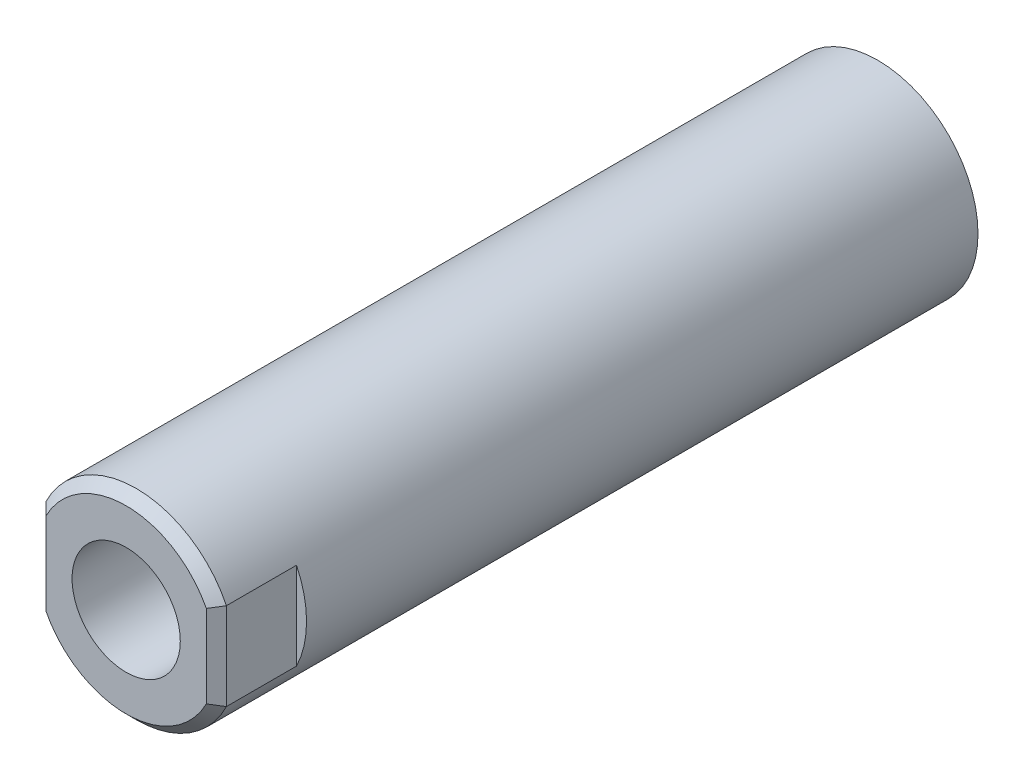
ISO-10303-21;
HEADER;
FILE_DESCRIPTION(('STEP AP214'),'2;1');
FILE_NAME('part.step','',(''),(''),'','','');
FILE_SCHEMA(('AUTOMOTIVE_DESIGN { 1 0 10303 214 1 1 1 1 }'));
ENDSEC;
DATA;
#1=APPLICATION_CONTEXT('core data for automotive mechanical design processes');
#2=APPLICATION_PROTOCOL_DEFINITION('international standard','automotive_design',2000,#1);
#3=PRODUCT_CONTEXT('',#1,'mechanical');
#4=PRODUCT('Part','Part','',(#3));
#5=PRODUCT_RELATED_PRODUCT_CATEGORY('part','',(#4));
#6=PRODUCT_DEFINITION_FORMATION('','',#4);
#7=PRODUCT_DEFINITION_CONTEXT('part definition',#1,'design');
#8=PRODUCT_DEFINITION('design','',#6,#7);
#9=PRODUCT_DEFINITION_SHAPE('','',#8);
#10=(LENGTH_UNIT() NAMED_UNIT(*) SI_UNIT(.MILLI.,.METRE.));
#11=(NAMED_UNIT(*) PLANE_ANGLE_UNIT() SI_UNIT($,.RADIAN.));
#12=(NAMED_UNIT(*) SI_UNIT($,.STERADIAN.) SOLID_ANGLE_UNIT());
#13=UNCERTAINTY_MEASURE_WITH_UNIT(LENGTH_MEASURE(1.E-05),#10,'distance_accuracy_value','');
#14=(GEOMETRIC_REPRESENTATION_CONTEXT(3) GLOBAL_UNCERTAINTY_ASSIGNED_CONTEXT((#13)) GLOBAL_UNIT_ASSIGNED_CONTEXT((#10,
#11,#12)) REPRESENTATION_CONTEXT('',''));
#15=CARTESIAN_POINT('',(0.,0.,0.));
#16=DIRECTION('',(0.,0.,1.));
#17=DIRECTION('',(1.,0.,0.));
#18=AXIS2_PLACEMENT_3D('',#15,#16,#17);
#19=CARTESIAN_POINT('',(0.,0.,-75.));
#20=DIRECTION('',(0.,0.,1.));
#21=DIRECTION('',(1.,0.,0.));
#22=AXIS2_PLACEMENT_3D('',#19,#20,#21);
#23=CYLINDRICAL_SURFACE('',#22,10.);
#24=DIRECTION('',(0.,0.,1.));
#25=VECTOR('',#24,1.);
#26=CARTESIAN_POINT('',(9.,-4.35889894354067,-75.));
#27=LINE('',#26,#25);
#28=CARTESIAN_POINT('',(9.,-4.35889894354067,-0.999999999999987));
#29=VERTEX_POINT('',#28);
#30=CARTESIAN_POINT('',(9.,-4.35889894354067,-7.99999999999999));
#31=VERTEX_POINT('',#30);
#32=EDGE_CURVE('E120',#29,#31,#27,.F.);
#33=ORIENTED_EDGE('',*,*,#32,.F.);
#34=CARTESIAN_POINT('',(0.,0.,-1.));
#35=DIRECTION('',(0.,0.,1.));
#36=DIRECTION('',(1.,0.,0.));
#37=AXIS2_PLACEMENT_3D('',#34,#35,#36);
#38=CIRCLE('',#37,10.);
#39=CARTESIAN_POINT('',(-9.,-4.35889894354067,-0.999999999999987));
#40=VERTEX_POINT('',#39);
#41=EDGE_CURVE('E46',#29,#40,#38,.F.);
#42=ORIENTED_EDGE('',*,*,#41,.T.);
#43=DIRECTION('',(0.,0.,1.));
#44=VECTOR('',#43,1.);
#45=CARTESIAN_POINT('',(-9.,-4.35889894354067,-75.));
#46=LINE('',#45,#44);
#47=CARTESIAN_POINT('',(-9.,-4.35889894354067,-8.));
#48=VERTEX_POINT('',#47);
#49=EDGE_CURVE('E106',#48,#40,#46,.T.);
#50=ORIENTED_EDGE('',*,*,#49,.F.);
#51=CARTESIAN_POINT('',(0.,0.,-7.99999999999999));
#52=DIRECTION('',(0.,0.,-1.));
#53=DIRECTION('',(-1.,0.,0.));
#54=AXIS2_PLACEMENT_3D('',#51,#52,#53);
#55=CIRCLE('',#54,10.);
#56=CARTESIAN_POINT('',(-9.,4.35889894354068,-8.));
#57=VERTEX_POINT('',#56);
#58=EDGE_CURVE('E127',#57,#48,#55,.F.);
#59=ORIENTED_EDGE('',*,*,#58,.F.);
#60=DIRECTION('',(0.,0.,1.));
#61=VECTOR('',#60,1.);
#62=CARTESIAN_POINT('',(-9.,4.35889894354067,-75.));
#63=LINE('',#62,#61);
#64=CARTESIAN_POINT('',(-9.,4.35889894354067,-0.999999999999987));
#65=VERTEX_POINT('',#64);
#66=EDGE_CURVE('E112',#65,#57,#63,.F.);
#67=ORIENTED_EDGE('',*,*,#66,.F.);
#68=CARTESIAN_POINT('',(0.,0.,-1.));
#69=DIRECTION('',(0.,0.,1.));
#70=DIRECTION('',(1.,0.,0.));
#71=AXIS2_PLACEMENT_3D('',#68,#69,#70);
#72=CIRCLE('',#71,10.);
#73=CARTESIAN_POINT('',(9.,4.35889894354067,-0.999999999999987));
#74=VERTEX_POINT('',#73);
#75=EDGE_CURVE('E141',#65,#74,#72,.F.);
#76=ORIENTED_EDGE('',*,*,#75,.T.);
#77=DIRECTION('',(0.,0.,1.));
#78=VECTOR('',#77,1.);
#79=CARTESIAN_POINT('',(9.,4.35889894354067,-75.));
#80=LINE('',#79,#78);
#81=CARTESIAN_POINT('',(9.,4.35889894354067,-7.99999999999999));
#82=VERTEX_POINT('',#81);
#83=EDGE_CURVE('E117',#82,#74,#80,.T.);
#84=ORIENTED_EDGE('',*,*,#83,.F.);
#85=CARTESIAN_POINT('',(0.,0.,-7.99999999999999));
#86=DIRECTION('',(0.,0.,-1.));
#87=DIRECTION('',(-1.,0.,0.));
#88=AXIS2_PLACEMENT_3D('',#85,#86,#87);
#89=CIRCLE('',#88,10.);
#90=EDGE_CURVE('E125',#31,#82,#89,.F.);
#91=ORIENTED_EDGE('',*,*,#90,.F.);
#92=EDGE_LOOP('',(#33,#42,#50,#59,#67,#76,#84,#91));
#93=FACE_BOUND('',#92,.T.);
#94=CARTESIAN_POINT('',(0.,0.,-75.));
#95=DIRECTION('',(0.,0.,1.));
#96=DIRECTION('',(1.,0.,0.));
#97=AXIS2_PLACEMENT_3D('',#94,#95,#96);
#98=CIRCLE('',#97,10.);
#99=CARTESIAN_POINT('',(10.,0.,-75.));
#100=VERTEX_POINT('',#99);
#101=EDGE_CURVE('E122',#100,#100,#98,.T.);
#102=ORIENTED_EDGE('',*,*,#101,.T.);
#103=EDGE_LOOP('',(#102));
#104=FACE_BOUND('',#103,.T.);
#105=ADVANCED_FACE('F33',(#93,#104),#23,.T.);
#106=CARTESIAN_POINT('',(0.,0.,-75.));
#107=DIRECTION('',(0.,0.,1.));
#108=DIRECTION('',(1.,0.,0.));
#109=AXIS2_PLACEMENT_3D('',#106,#107,#108);
#110=PLANE('',#109);
#111=ORIENTED_EDGE('',*,*,#101,.F.);
#112=EDGE_LOOP('',(#111));
#113=FACE_BOUND('',#112,.T.);
#114=ADVANCED_FACE('F176',(#113),#110,.F.);
#115=CARTESIAN_POINT('',(0.,0.,0.));
#116=DIRECTION('',(0.,0.,1.));
#117=DIRECTION('',(1.,0.,0.));
#118=AXIS2_PLACEMENT_3D('',#115,#116,#117);
#119=PLANE('',#118);
#120=CARTESIAN_POINT('',(0.,0.,0.));
#121=DIRECTION('',(0.,0.,1.));
#122=DIRECTION('',(1.,0.,0.));
#123=AXIS2_PLACEMENT_3D('',#120,#121,#122);
#124=CIRCLE('',#123,9.00000000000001);
#125=CARTESIAN_POINT('',(-8.00000000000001,-4.12310562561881,0.));
#126=VERTEX_POINT('',#125);
#127=CARTESIAN_POINT('',(7.99999999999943,-4.12310562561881,0.));
#128=VERTEX_POINT('',#127);
#129=EDGE_CURVE('E136',#126,#128,#124,.T.);
#130=ORIENTED_EDGE('',*,*,#129,.T.);
#131=DIRECTION('',(0.,1.,0.));
#132=VECTOR('',#131,1.);
#133=CARTESIAN_POINT('',(8.00000000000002,4.35889894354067,0.));
#134=LINE('',#133,#132);
#135=CARTESIAN_POINT('',(7.99999999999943,4.12310562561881,0.));
#136=VERTEX_POINT('',#135);
#137=EDGE_CURVE('E138',#128,#136,#134,.T.);
#138=ORIENTED_EDGE('',*,*,#137,.T.);
#139=CARTESIAN_POINT('',(0.,0.,0.));
#140=DIRECTION('',(0.,0.,1.));
#141=DIRECTION('',(1.,0.,0.));
#142=AXIS2_PLACEMENT_3D('',#139,#140,#141);
#143=CIRCLE('',#142,9.00000000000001);
#144=CARTESIAN_POINT('',(-7.99999999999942,4.12310562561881,0.));
#145=VERTEX_POINT('',#144);
#146=EDGE_CURVE('E132',#136,#145,#143,.T.);
#147=ORIENTED_EDGE('',*,*,#146,.T.);
#148=DIRECTION('',(0.,-1.,0.));
#149=VECTOR('',#148,1.);
#150=CARTESIAN_POINT('',(-8.00000000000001,-4.35889894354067,0.));
#151=LINE('',#150,#149);
#152=EDGE_CURVE('E134',#145,#126,#151,.T.);
#153=ORIENTED_EDGE('',*,*,#152,.T.);
#154=EDGE_LOOP('',(#130,#138,#147,#153));
#155=FACE_BOUND('',#154,.T.);
#156=CARTESIAN_POINT('',(0.,0.,0.));
#157=DIRECTION('',(0.,0.,1.));
#158=DIRECTION('',(1.,0.,0.));
#159=AXIS2_PLACEMENT_3D('',#156,#157,#158);
#160=CIRCLE('',#159,5.39999999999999);
#161=CARTESIAN_POINT('',(5.39999999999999,0.,0.));
#162=VERTEX_POINT('',#161);
#163=EDGE_CURVE('E103',#162,#162,#160,.T.);
#164=ORIENTED_EDGE('',*,*,#163,.F.);
#165=EDGE_LOOP('',(#164));
#166=FACE_BOUND('',#165,.T.);
#167=ADVANCED_FACE('F180',(#155,#166),#119,.T.);
#168=CARTESIAN_POINT('',(9.,-10.5,0.));
#169=DIRECTION('',(-1.,0.,0.));
#170=DIRECTION('',(0.,0.,1.));
#171=AXIS2_PLACEMENT_3D('',#168,#169,#170);
#172=PLANE('',#171);
#173=ORIENTED_EDGE('',*,*,#83,.T.);
#174=DIRECTION('',(0.,-1.,0.));
#175=VECTOR('',#174,1.);
#176=CARTESIAN_POINT('',(9.,-4.35889894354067,-0.999999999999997));
#177=LINE('',#176,#175);
#178=EDGE_CURVE('E129',#74,#29,#177,.T.);
#179=ORIENTED_EDGE('',*,*,#178,.T.);
#180=ORIENTED_EDGE('',*,*,#32,.T.);
#181=DIRECTION('',(0.,1.,0.));
#182=VECTOR('',#181,1.);
#183=CARTESIAN_POINT('',(9.,-10.5,-8.));
#184=LINE('',#183,#182);
#185=EDGE_CURVE('E114',#31,#82,#184,.T.);
#186=ORIENTED_EDGE('',*,*,#185,.T.);
#187=EDGE_LOOP('',(#173,#179,#180,#186));
#188=FACE_BOUND('',#187,.T.);
#189=ADVANCED_FACE('F186',(#188),#172,.F.);
#190=CARTESIAN_POINT('',(9.,-10.5,-8.));
#191=DIRECTION('',(0.,0.,-1.));
#192=DIRECTION('',(-1.,0.,0.));
#193=AXIS2_PLACEMENT_3D('',#190,#191,#192);
#194=PLANE('',#193);
#195=ORIENTED_EDGE('',*,*,#90,.T.);
#196=ORIENTED_EDGE('',*,*,#185,.F.);
#197=EDGE_LOOP('',(#195,#196));
#198=FACE_BOUND('',#197,.T.);
#199=ADVANCED_FACE('F191',(#198),#194,.F.);
#200=CARTESIAN_POINT('',(-11.5,-10.5,-8.));
#201=DIRECTION('',(0.,0.,-1.));
#202=DIRECTION('',(-1.,0.,0.));
#203=AXIS2_PLACEMENT_3D('',#200,#201,#202);
#204=PLANE('',#203);
#205=ORIENTED_EDGE('',*,*,#58,.T.);
#206=DIRECTION('',(0.,1.,0.));
#207=VECTOR('',#206,1.);
#208=CARTESIAN_POINT('',(-9.,-10.5,-8.));
#209=LINE('',#208,#207);
#210=EDGE_CURVE('E102',#48,#57,#209,.T.);
#211=ORIENTED_EDGE('',*,*,#210,.T.);
#212=EDGE_LOOP('',(#205,#211));
#213=FACE_BOUND('',#212,.T.);
#214=ADVANCED_FACE('F195',(#213),#204,.F.);
#215=CARTESIAN_POINT('',(-9.,-10.5,0.));
#216=DIRECTION('',(1.,0.,0.));
#217=DIRECTION('',(0.,0.,-1.));
#218=AXIS2_PLACEMENT_3D('',#215,#216,#217);
#219=PLANE('',#218);
#220=ORIENTED_EDGE('',*,*,#49,.T.);
#221=DIRECTION('',(0.,1.,0.));
#222=VECTOR('',#221,1.);
#223=CARTESIAN_POINT('',(-9.,4.35889894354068,-0.999999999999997));
#224=LINE('',#223,#222);
#225=EDGE_CURVE('E11',#40,#65,#224,.T.);
#226=ORIENTED_EDGE('',*,*,#225,.T.);
#227=ORIENTED_EDGE('',*,*,#66,.T.);
#228=ORIENTED_EDGE('',*,*,#210,.F.);
#229=EDGE_LOOP('',(#220,#226,#227,#228));
#230=FACE_BOUND('',#229,.T.);
#231=ADVANCED_FACE('F96',(#230),#219,.F.);
#232=CARTESIAN_POINT('',(0.,0.,-24.75));
#233=DIRECTION('',(0.,0.,1.));
#234=DIRECTION('',(1.,0.,0.));
#235=AXIS2_PLACEMENT_3D('',#232,#233,#234);
#236=CONICAL_SURFACE('',#235,5.39999999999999,1.02974425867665);
#237=CARTESIAN_POINT('',(0.,0.,-27.9946473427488));
#238=VERTEX_POINT('',#237);
#239=VERTEX_LOOP('',#238);
#240=FACE_BOUND('',#239,.T.);
#241=CARTESIAN_POINT('',(0.,0.,-24.75));
#242=DIRECTION('',(0.,0.,1.));
#243=DIRECTION('',(1.,0.,0.));
#244=AXIS2_PLACEMENT_3D('',#241,#242,#243);
#245=CIRCLE('',#244,5.39999999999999);
#246=CARTESIAN_POINT('',(5.39999999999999,0.,-24.75));
#247=VERTEX_POINT('',#246);
#248=EDGE_CURVE('E100',#247,#247,#245,.T.);
#249=ORIENTED_EDGE('',*,*,#248,.T.);
#250=EDGE_LOOP('',(#249));
#251=FACE_BOUND('',#250,.T.);
#252=ADVANCED_FACE('F92',(#240,#251),#236,.F.);
#253=CARTESIAN_POINT('',(0.,0.,0.));
#254=DIRECTION('',(0.,0.,1.));
#255=DIRECTION('',(1.,0.,0.));
#256=AXIS2_PLACEMENT_3D('',#253,#254,#255);
#257=CYLINDRICAL_SURFACE('',#256,5.39999999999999);
#258=ORIENTED_EDGE('',*,*,#248,.F.);
#259=EDGE_LOOP('',(#258));
#260=FACE_BOUND('',#259,.T.);
#261=ORIENTED_EDGE('',*,*,#163,.T.);
#262=EDGE_LOOP('',(#261));
#263=FACE_BOUND('',#262,.T.);
#264=ADVANCED_FACE('F95',(#260,#263),#257,.F.);
#265=CARTESIAN_POINT('',(-9.,-10.5,-0.999999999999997));
#266=DIRECTION('',(-0.707106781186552,0.,0.707106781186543));
#267=DIRECTION('',(0.707106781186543,0.,0.707106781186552));
#268=AXIS2_PLACEMENT_3D('',#265,#266,#267);
#269=PLANE('',#268);
#270=CARTESIAN_POINT('',(-9.,-4.35889894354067,-0.999999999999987));
#271=CARTESIAN_POINT('',(-8.83320808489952,-4.32066280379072,-0.83320808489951));
#272=CARTESIAN_POINT('',(-8.66647881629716,-4.28189529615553,-0.666478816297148));
#273=CARTESIAN_POINT('',(-8.33314548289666,-4.20329752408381,-0.333145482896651));
#274=CARTESIAN_POINT('',(-8.16654141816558,-4.16346725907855,-0.166541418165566));
#275=CARTESIAN_POINT('',(-7.99999999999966,-4.12310562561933,3.53197194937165E-13));
#276=B_SPLINE_CURVE_WITH_KNOTS('',3,(#270,#271,#272,#273,#274,#275),.UNSPECIFIED.,.F.,.F.,(4,2,
4),(0.,0.716869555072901,1.43373949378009),.UNSPECIFIED.);
#277=EDGE_CURVE('E289',#126,#40,#276,.F.);
#278=ORIENTED_EDGE('',*,*,#277,.F.);
#279=ORIENTED_EDGE('',*,*,#152,.F.);
#280=CARTESIAN_POINT('',(-9.,4.35889894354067,-0.999999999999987));
#281=CARTESIAN_POINT('',(-8.83320808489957,4.32066280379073,-0.833208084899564));
#282=CARTESIAN_POINT('',(-8.66647881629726,4.28189529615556,-0.666478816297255));
#283=CARTESIAN_POINT('',(-8.33314548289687,4.20329752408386,-0.333145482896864));
#284=CARTESIAN_POINT('',(-8.16654141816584,4.16346725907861,-0.166541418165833));
#285=CARTESIAN_POINT('',(-7.99999999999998,4.1231056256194,0.));
#286=B_SPLINE_CURVE_WITH_KNOTS('',3,(#280,#281,#282,#283,#284,#285),.UNSPECIFIED.,.F.,.F.,(4,2,
4),(0.,0.716869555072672,1.43373949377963),.UNSPECIFIED.);
#287=EDGE_CURVE('E38',#65,#145,#286,.T.);
#288=ORIENTED_EDGE('',*,*,#287,.F.);
#289=ORIENTED_EDGE('',*,*,#225,.F.);
#290=EDGE_LOOP('',(#278,#279,#288,#289));
#291=FACE_BOUND('',#290,.T.);
#292=ADVANCED_FACE('F35',(#291),#269,.T.);
#293=CARTESIAN_POINT('',(0.,0.,0.));
#294=DIRECTION('',(0.,0.,-1.));
#295=DIRECTION('',(-1.,0.,0.));
#296=AXIS2_PLACEMENT_3D('',#293,#294,#295);
#297=CONICAL_SURFACE('',#296,9.00000000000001,0.785398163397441);
#298=ORIENTED_EDGE('',*,*,#287,.T.);
#299=ORIENTED_EDGE('',*,*,#146,.F.);
#300=CARTESIAN_POINT('',(8.00000000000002,4.12310562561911,0.));
#301=CARTESIAN_POINT('',(8.1665414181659,4.16346725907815,-0.166541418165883));
#302=CARTESIAN_POINT('',(8.33314548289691,4.20329752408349,-0.333145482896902));
#303=CARTESIAN_POINT('',(8.66647881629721,4.28189529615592,-0.666478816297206));
#304=CARTESIAN_POINT('',(8.83320808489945,4.32066280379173,-0.833208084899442));
#305=CARTESIAN_POINT('',(8.99999999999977,4.35889894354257,-0.999999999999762));
#306=B_SPLINE_CURVE_WITH_KNOTS('',3,(#300,#301,#302,#303,#304,#305),.UNSPECIFIED.,.F.,.F.,(4,2,
4),(0.,0.716869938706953,1.43373949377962),.UNSPECIFIED.);
#307=EDGE_CURVE('E151',#74,#136,#306,.F.);
#308=ORIENTED_EDGE('',*,*,#307,.F.);
#309=ORIENTED_EDGE('',*,*,#75,.F.);
#310=EDGE_LOOP('',(#298,#299,#308,#309));
#311=FACE_BOUND('',#310,.T.);
#312=ADVANCED_FACE('F162',(#311),#297,.T.);
#313=CARTESIAN_POINT('',(0.,0.,0.));
#314=DIRECTION('',(0.,0.,-1.));
#315=DIRECTION('',(-1.,0.,0.));
#316=AXIS2_PLACEMENT_3D('',#313,#314,#315);
#317=CONICAL_SURFACE('',#316,9.00000000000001,0.785398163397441);
#318=ORIENTED_EDGE('',*,*,#277,.T.);
#319=ORIENTED_EDGE('',*,*,#41,.F.);
#320=CARTESIAN_POINT('',(9.,-4.35889894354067,-0.999999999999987));
#321=CARTESIAN_POINT('',(8.83320808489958,-4.32066280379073,-0.833208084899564));
#322=CARTESIAN_POINT('',(8.66647881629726,-4.28189529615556,-0.666478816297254));
#323=CARTESIAN_POINT('',(8.33314548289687,-4.20329752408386,-0.333145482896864));
#324=CARTESIAN_POINT('',(8.16654141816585,-4.16346725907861,-0.166541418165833));
#325=CARTESIAN_POINT('',(7.99999999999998,-4.1231056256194,0.));
#326=B_SPLINE_CURVE_WITH_KNOTS('',3,(#320,#321,#322,#323,#324,#325),.UNSPECIFIED.,.F.,.F.,(4,2,
4),(0.,0.716869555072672,1.43373949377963),.UNSPECIFIED.);
#327=EDGE_CURVE('E144',#128,#29,#326,.F.);
#328=ORIENTED_EDGE('',*,*,#327,.F.);
#329=ORIENTED_EDGE('',*,*,#129,.F.);
#330=EDGE_LOOP('',(#318,#319,#328,#329));
#331=FACE_BOUND('',#330,.T.);
#332=ADVANCED_FACE('F155',(#331),#317,.T.);
#333=CARTESIAN_POINT('',(9.,-10.5,-0.999999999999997));
#334=DIRECTION('',(0.707106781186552,0.,0.707106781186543));
#335=DIRECTION('',(0.707106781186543,0.,-0.707106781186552));
#336=AXIS2_PLACEMENT_3D('',#333,#334,#335);
#337=PLANE('',#336);
#338=ORIENTED_EDGE('',*,*,#307,.T.);
#339=ORIENTED_EDGE('',*,*,#137,.F.);
#340=ORIENTED_EDGE('',*,*,#327,.T.);
#341=ORIENTED_EDGE('',*,*,#178,.F.);
#342=EDGE_LOOP('',(#338,#339,#340,#341));
#343=FACE_BOUND('',#342,.T.);
#344=ADVANCED_FACE('F158',(#343),#337,.T.);
#345=CLOSED_SHELL('',(#105,#114,#167,#189,#199,#214,#231,#252,#264,#292,#312,#332,#344));
#346=MANIFOLD_SOLID_BREP('B2',#345);
#347=ADVANCED_BREP_SHAPE_REPRESENTATION('',(#18,#346),#14);
#348=SHAPE_DEFINITION_REPRESENTATION(#9,#347);
ENDSEC;
END-ISO-10303-21;
